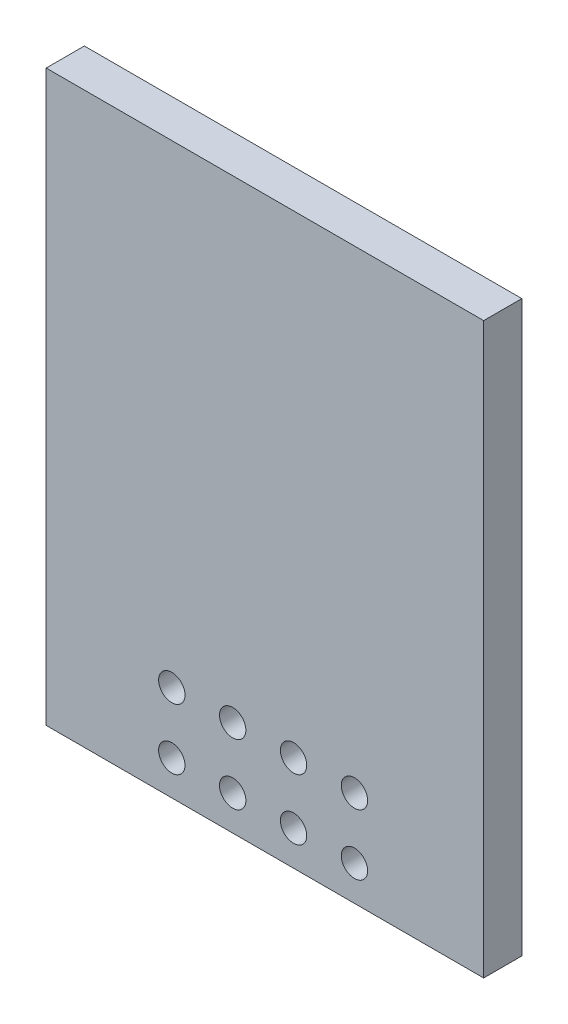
ISO-10303-21;
HEADER;
FILE_DESCRIPTION(('STEP AP214'),'2;1');
FILE_NAME('part.step','',(''),(''),'','','');
FILE_SCHEMA(('AUTOMOTIVE_DESIGN { 1 0 10303 214 1 1 1 1 }'));
ENDSEC;
DATA;
#1=APPLICATION_CONTEXT('core data for automotive mechanical design processes');
#2=APPLICATION_PROTOCOL_DEFINITION('international standard','automotive_design',2000,#1);
#3=PRODUCT_CONTEXT('',#1,'mechanical');
#4=PRODUCT('Part','Part','',(#3));
#5=PRODUCT_RELATED_PRODUCT_CATEGORY('part','',(#4));
#6=PRODUCT_DEFINITION_FORMATION('','',#4);
#7=PRODUCT_DEFINITION_CONTEXT('part definition',#1,'design');
#8=PRODUCT_DEFINITION('design','',#6,#7);
#9=PRODUCT_DEFINITION_SHAPE('','',#8);
#10=(LENGTH_UNIT() NAMED_UNIT(*) SI_UNIT(.MILLI.,.METRE.));
#11=(NAMED_UNIT(*) PLANE_ANGLE_UNIT() SI_UNIT($,.RADIAN.));
#12=(NAMED_UNIT(*) SI_UNIT($,.STERADIAN.) SOLID_ANGLE_UNIT());
#13=UNCERTAINTY_MEASURE_WITH_UNIT(LENGTH_MEASURE(1.E-05),#10,'distance_accuracy_value','');
#14=(GEOMETRIC_REPRESENTATION_CONTEXT(3) GLOBAL_UNCERTAINTY_ASSIGNED_CONTEXT((#13)) GLOBAL_UNIT_ASSIGNED_CONTEXT((#10,
#11,#12)) REPRESENTATION_CONTEXT('',''));
#15=CARTESIAN_POINT('',(0.,0.,0.));
#16=DIRECTION('',(0.,0.,1.));
#17=DIRECTION('',(1.,0.,0.));
#18=AXIS2_PLACEMENT_3D('',#15,#16,#17);
#19=CARTESIAN_POINT('',(26.25,26.25,1.59143954));
#20=DIRECTION('',(0.,0.,-1.));
#21=DIRECTION('',(-1.,0.,0.));
#22=AXIS2_PLACEMENT_3D('',#19,#20,#21);
#23=PLANE('',#22);
#24=CARTESIAN_POINT('',(39.11000052,30.24000048,1.59143954));
#25=DIRECTION('',(0.,0.,-1.));
#26=DIRECTION('',(-1.,0.,0.));
#27=AXIS2_PLACEMENT_3D('',#24,#25,#26);
#28=CIRCLE('',#27,0.5499989);
#29=CARTESIAN_POINT('',(38.56000162,30.24000048,1.59143954));
#30=VERTEX_POINT('',#29);
#31=EDGE_CURVE('E103',#30,#30,#28,.T.);
#32=ORIENTED_EDGE('',*,*,#31,.T.);
#33=EDGE_LOOP('',(#32));
#34=FACE_BOUND('',#33,.T.);
#35=CARTESIAN_POINT('',(36.57000052,30.24000048,1.59143954));
#36=DIRECTION('',(0.,0.,-1.));
#37=DIRECTION('',(-1.,0.,0.));
#38=AXIS2_PLACEMENT_3D('',#35,#36,#37);
#39=CIRCLE('',#38,0.5499989);
#40=CARTESIAN_POINT('',(36.02000162,30.24000048,1.59143954));
#41=VERTEX_POINT('',#40);
#42=EDGE_CURVE('E107',#41,#41,#39,.T.);
#43=ORIENTED_EDGE('',*,*,#42,.T.);
#44=EDGE_LOOP('',(#43));
#45=FACE_BOUND('',#44,.T.);
#46=CARTESIAN_POINT('',(39.11000052,27.70000048,1.59143954));
#47=DIRECTION('',(0.,0.,-1.));
#48=DIRECTION('',(-1.,0.,0.));
#49=AXIS2_PLACEMENT_3D('',#46,#47,#48);
#50=CIRCLE('',#49,0.5499989);
#51=CARTESIAN_POINT('',(38.56000162,27.70000048,1.59143954));
#52=VERTEX_POINT('',#51);
#53=EDGE_CURVE('E110',#52,#52,#50,.T.);
#54=ORIENTED_EDGE('',*,*,#53,.T.);
#55=EDGE_LOOP('',(#54));
#56=FACE_BOUND('',#55,.T.);
#57=CARTESIAN_POINT('',(36.57000052,27.70000048,1.59143954));
#58=DIRECTION('',(0.,0.,-1.));
#59=DIRECTION('',(-1.,0.,0.));
#60=AXIS2_PLACEMENT_3D('',#57,#58,#59);
#61=CIRCLE('',#60,0.5499989);
#62=CARTESIAN_POINT('',(36.02000162,27.70000048,1.59143954));
#63=VERTEX_POINT('',#62);
#64=EDGE_CURVE('E113',#63,#63,#61,.T.);
#65=ORIENTED_EDGE('',*,*,#64,.T.);
#66=EDGE_LOOP('',(#65));
#67=FACE_BOUND('',#66,.T.);
#68=CARTESIAN_POINT('',(34.03000052,30.24000048,1.59143954));
#69=DIRECTION('',(0.,0.,-1.));
#70=DIRECTION('',(-1.,0.,0.));
#71=AXIS2_PLACEMENT_3D('',#68,#69,#70);
#72=CIRCLE('',#71,0.5499989);
#73=CARTESIAN_POINT('',(33.48000162,30.24000048,1.59143954));
#74=VERTEX_POINT('',#73);
#75=EDGE_CURVE('E116',#74,#74,#72,.T.);
#76=ORIENTED_EDGE('',*,*,#75,.T.);
#77=EDGE_LOOP('',(#76));
#78=FACE_BOUND('',#77,.T.);
#79=CARTESIAN_POINT('',(31.49000052,30.24000048,1.59143954));
#80=DIRECTION('',(0.,0.,-1.));
#81=DIRECTION('',(-1.,0.,0.));
#82=AXIS2_PLACEMENT_3D('',#79,#80,#81);
#83=CIRCLE('',#82,0.5499989);
#84=CARTESIAN_POINT('',(30.94000162,30.24000048,1.59143954));
#85=VERTEX_POINT('',#84);
#86=EDGE_CURVE('E119',#85,#85,#83,.T.);
#87=ORIENTED_EDGE('',*,*,#86,.T.);
#88=EDGE_LOOP('',(#87));
#89=FACE_BOUND('',#88,.T.);
#90=CARTESIAN_POINT('',(34.03000052,27.70000048,1.59143954));
#91=DIRECTION('',(0.,0.,-1.));
#92=DIRECTION('',(-1.,0.,0.));
#93=AXIS2_PLACEMENT_3D('',#90,#91,#92);
#94=CIRCLE('',#93,0.5499989);
#95=CARTESIAN_POINT('',(33.48000162,27.70000048,1.59143954));
#96=VERTEX_POINT('',#95);
#97=EDGE_CURVE('E121',#96,#96,#94,.T.);
#98=ORIENTED_EDGE('',*,*,#97,.T.);
#99=EDGE_LOOP('',(#98));
#100=FACE_BOUND('',#99,.T.);
#101=CARTESIAN_POINT('',(31.49000052,27.70000048,1.59143954));
#102=DIRECTION('',(0.,0.,-1.));
#103=DIRECTION('',(-1.,0.,0.));
#104=AXIS2_PLACEMENT_3D('',#101,#102,#103);
#105=CIRCLE('',#104,0.5499989);
#106=CARTESIAN_POINT('',(30.94000162,27.70000048,1.59143954));
#107=VERTEX_POINT('',#106);
#108=EDGE_CURVE('E20',#107,#107,#105,.T.);
#109=ORIENTED_EDGE('',*,*,#108,.T.);
#110=EDGE_LOOP('',(#109));
#111=FACE_BOUND('',#110,.T.);
#112=DIRECTION('',(0.,1.,0.));
#113=VECTOR('',#112,1.);
#114=CARTESIAN_POINT('',(44.5,26.25,1.59143954));
#115=LINE('',#114,#113);
#116=CARTESIAN_POINT('',(44.5,26.25,1.59143954));
#117=VERTEX_POINT('',#116);
#118=CARTESIAN_POINT('',(44.5,50.,1.59143954));
#119=VERTEX_POINT('',#118);
#120=EDGE_CURVE('E55',#117,#119,#115,.T.);
#121=ORIENTED_EDGE('',*,*,#120,.T.);
#122=DIRECTION('',(1.,0.,0.));
#123=VECTOR('',#122,1.);
#124=CARTESIAN_POINT('',(44.5,50.,1.59143954));
#125=LINE('',#124,#123);
#126=CARTESIAN_POINT('',(26.25,50.,1.59143954));
#127=VERTEX_POINT('',#126);
#128=EDGE_CURVE('E57',#119,#127,#125,.F.);
#129=ORIENTED_EDGE('',*,*,#128,.T.);
#130=DIRECTION('',(0.,1.,0.));
#131=VECTOR('',#130,1.);
#132=CARTESIAN_POINT('',(26.25,50.,1.59143954));
#133=LINE('',#132,#131);
#134=CARTESIAN_POINT('',(26.25,26.25,1.59143954));
#135=VERTEX_POINT('',#134);
#136=EDGE_CURVE('E59',#127,#135,#133,.F.);
#137=ORIENTED_EDGE('',*,*,#136,.T.);
#138=DIRECTION('',(1.,0.,0.));
#139=VECTOR('',#138,1.);
#140=CARTESIAN_POINT('',(26.25,26.25,1.59143954));
#141=LINE('',#140,#139);
#142=EDGE_CURVE('E128',#135,#117,#141,.T.);
#143=ORIENTED_EDGE('',*,*,#142,.T.);
#144=EDGE_LOOP('',(#121,#129,#137,#143));
#145=FACE_BOUND('',#144,.T.);
#146=ADVANCED_FACE('F17',(#34,#45,#56,#67,#78,#89,#100,#111,#145),#23,.F.);
#147=CARTESIAN_POINT('',(26.25,50.,0.));
#148=DIRECTION('',(1.,0.,0.));
#149=DIRECTION('',(0.,0.,-1.));
#150=AXIS2_PLACEMENT_3D('',#147,#148,#149);
#151=PLANE('',#150);
#152=DIRECTION('',(0.,0.,1.));
#153=VECTOR('',#152,1.);
#154=CARTESIAN_POINT('',(26.25,26.25,0.));
#155=LINE('',#154,#153);
#156=CARTESIAN_POINT('',(26.25,26.25,0.));
#157=VERTEX_POINT('',#156);
#158=EDGE_CURVE('E70',#157,#135,#155,.T.);
#159=ORIENTED_EDGE('',*,*,#158,.T.);
#160=ORIENTED_EDGE('',*,*,#136,.F.);
#161=DIRECTION('',(0.,0.,-1.));
#162=VECTOR('',#161,1.);
#163=CARTESIAN_POINT('',(26.25,50.,0.));
#164=LINE('',#163,#162);
#165=CARTESIAN_POINT('',(26.25,50.,0.));
#166=VERTEX_POINT('',#165);
#167=EDGE_CURVE('E64',#127,#166,#164,.T.);
#168=ORIENTED_EDGE('',*,*,#167,.T.);
#169=DIRECTION('',(0.,1.,0.));
#170=VECTOR('',#169,1.);
#171=CARTESIAN_POINT('',(26.25,26.25,0.));
#172=LINE('',#171,#170);
#173=EDGE_CURVE('E106',#157,#166,#172,.T.);
#174=ORIENTED_EDGE('',*,*,#173,.F.);
#175=EDGE_LOOP('',(#159,#160,#168,#174));
#176=FACE_BOUND('',#175,.T.);
#177=ADVANCED_FACE('F67',(#176),#151,.F.);
#178=CARTESIAN_POINT('',(44.5,50.,0.));
#179=DIRECTION('',(0.,-1.,0.));
#180=DIRECTION('',(0.,0.,-1.));
#181=AXIS2_PLACEMENT_3D('',#178,#179,#180);
#182=PLANE('',#181);
#183=ORIENTED_EDGE('',*,*,#167,.F.);
#184=ORIENTED_EDGE('',*,*,#128,.F.);
#185=DIRECTION('',(0.,0.,1.));
#186=VECTOR('',#185,1.);
#187=CARTESIAN_POINT('',(44.5,50.,0.));
#188=LINE('',#187,#186);
#189=CARTESIAN_POINT('',(44.5,50.,0.));
#190=VERTEX_POINT('',#189);
#191=EDGE_CURVE('E78',#119,#190,#188,.F.);
#192=ORIENTED_EDGE('',*,*,#191,.T.);
#193=DIRECTION('',(-1.,0.,0.));
#194=VECTOR('',#193,1.);
#195=CARTESIAN_POINT('',(26.25,50.,0.));
#196=LINE('',#195,#194);
#197=EDGE_CURVE('E75',#166,#190,#196,.F.);
#198=ORIENTED_EDGE('',*,*,#197,.F.);
#199=EDGE_LOOP('',(#183,#184,#192,#198));
#200=FACE_BOUND('',#199,.T.);
#201=ADVANCED_FACE('F73',(#200),#182,.F.);
#202=CARTESIAN_POINT('',(44.5,26.25,0.));
#203=DIRECTION('',(-1.,0.,0.));
#204=DIRECTION('',(0.,0.,1.));
#205=AXIS2_PLACEMENT_3D('',#202,#203,#204);
#206=PLANE('',#205);
#207=ORIENTED_EDGE('',*,*,#191,.F.);
#208=ORIENTED_EDGE('',*,*,#120,.F.);
#209=DIRECTION('',(0.,0.,1.));
#210=VECTOR('',#209,1.);
#211=CARTESIAN_POINT('',(44.5,26.25,0.));
#212=LINE('',#211,#210);
#213=CARTESIAN_POINT('',(44.5,26.25,0.));
#214=VERTEX_POINT('',#213);
#215=EDGE_CURVE('E35',#117,#214,#212,.F.);
#216=ORIENTED_EDGE('',*,*,#215,.T.);
#217=DIRECTION('',(0.,1.,0.));
#218=VECTOR('',#217,1.);
#219=CARTESIAN_POINT('',(44.5,26.25,0.));
#220=LINE('',#219,#218);
#221=EDGE_CURVE('E135',#190,#214,#220,.F.);
#222=ORIENTED_EDGE('',*,*,#221,.F.);
#223=EDGE_LOOP('',(#207,#208,#216,#222));
#224=FACE_BOUND('',#223,.T.);
#225=ADVANCED_FACE('F136',(#224),#206,.F.);
#226=CARTESIAN_POINT('',(26.25,26.25,0.));
#227=DIRECTION('',(0.,1.,0.));
#228=DIRECTION('',(0.,0.,1.));
#229=AXIS2_PLACEMENT_3D('',#226,#227,#228);
#230=PLANE('',#229);
#231=ORIENTED_EDGE('',*,*,#215,.F.);
#232=ORIENTED_EDGE('',*,*,#142,.F.);
#233=ORIENTED_EDGE('',*,*,#158,.F.);
#234=DIRECTION('',(-1.,0.,0.));
#235=VECTOR('',#234,1.);
#236=CARTESIAN_POINT('',(26.25,26.25,0.));
#237=LINE('',#236,#235);
#238=EDGE_CURVE('E102',#214,#157,#237,.T.);
#239=ORIENTED_EDGE('',*,*,#238,.F.);
#240=EDGE_LOOP('',(#231,#232,#233,#239));
#241=FACE_BOUND('',#240,.T.);
#242=ADVANCED_FACE('F143',(#241),#230,.F.);
#243=CARTESIAN_POINT('',(31.49000052,27.70000048,0.));
#244=DIRECTION('',(0.,0.,-1.));
#245=DIRECTION('',(-1.,0.,0.));
#246=AXIS2_PLACEMENT_3D('',#243,#244,#245);
#247=CYLINDRICAL_SURFACE('',#246,0.5499989);
#248=ORIENTED_EDGE('',*,*,#108,.F.);
#249=EDGE_LOOP('',(#248));
#250=FACE_BOUND('',#249,.T.);
#251=CARTESIAN_POINT('',(31.49000052,27.70000048,0.));
#252=DIRECTION('',(0.,0.,-1.));
#253=DIRECTION('',(-1.,0.,0.));
#254=AXIS2_PLACEMENT_3D('',#251,#252,#253);
#255=CIRCLE('',#254,0.5499989);
#256=CARTESIAN_POINT('',(30.94000162,27.70000048,0.));
#257=VERTEX_POINT('',#256);
#258=EDGE_CURVE('E99',#257,#257,#255,.F.);
#259=ORIENTED_EDGE('',*,*,#258,.F.);
#260=EDGE_LOOP('',(#259));
#261=FACE_BOUND('',#260,.T.);
#262=ADVANCED_FACE('F145',(#250,#261),#247,.F.);
#263=CARTESIAN_POINT('',(34.03000052,27.70000048,0.));
#264=DIRECTION('',(0.,0.,-1.));
#265=DIRECTION('',(-1.,0.,0.));
#266=AXIS2_PLACEMENT_3D('',#263,#264,#265);
#267=CYLINDRICAL_SURFACE('',#266,0.5499989);
#268=ORIENTED_EDGE('',*,*,#97,.F.);
#269=EDGE_LOOP('',(#268));
#270=FACE_BOUND('',#269,.T.);
#271=CARTESIAN_POINT('',(34.03000052,27.70000048,0.));
#272=DIRECTION('',(0.,0.,-1.));
#273=DIRECTION('',(-1.,0.,0.));
#274=AXIS2_PLACEMENT_3D('',#271,#272,#273);
#275=CIRCLE('',#274,0.5499989);
#276=CARTESIAN_POINT('',(33.48000162,27.70000048,0.));
#277=VERTEX_POINT('',#276);
#278=EDGE_CURVE('E96',#277,#277,#275,.F.);
#279=ORIENTED_EDGE('',*,*,#278,.F.);
#280=EDGE_LOOP('',(#279));
#281=FACE_BOUND('',#280,.T.);
#282=ADVANCED_FACE('F152',(#270,#281),#267,.F.);
#283=CARTESIAN_POINT('',(31.49000052,30.24000048,0.));
#284=DIRECTION('',(0.,0.,-1.));
#285=DIRECTION('',(-1.,0.,0.));
#286=AXIS2_PLACEMENT_3D('',#283,#284,#285);
#287=CYLINDRICAL_SURFACE('',#286,0.5499989);
#288=ORIENTED_EDGE('',*,*,#86,.F.);
#289=EDGE_LOOP('',(#288));
#290=FACE_BOUND('',#289,.T.);
#291=CARTESIAN_POINT('',(31.49000052,30.24000048,0.));
#292=DIRECTION('',(0.,0.,-1.));
#293=DIRECTION('',(-1.,0.,0.));
#294=AXIS2_PLACEMENT_3D('',#291,#292,#293);
#295=CIRCLE('',#294,0.5499989);
#296=CARTESIAN_POINT('',(30.94000162,30.24000048,0.));
#297=VERTEX_POINT('',#296);
#298=EDGE_CURVE('E93',#297,#297,#295,.F.);
#299=ORIENTED_EDGE('',*,*,#298,.F.);
#300=EDGE_LOOP('',(#299));
#301=FACE_BOUND('',#300,.T.);
#302=ADVANCED_FACE('F182',(#290,#301),#287,.F.);
#303=CARTESIAN_POINT('',(34.03000052,30.24000048,0.));
#304=DIRECTION('',(0.,0.,-1.));
#305=DIRECTION('',(-1.,0.,0.));
#306=AXIS2_PLACEMENT_3D('',#303,#304,#305);
#307=CYLINDRICAL_SURFACE('',#306,0.5499989);
#308=ORIENTED_EDGE('',*,*,#75,.F.);
#309=EDGE_LOOP('',(#308));
#310=FACE_BOUND('',#309,.T.);
#311=CARTESIAN_POINT('',(34.03000052,30.24000048,0.));
#312=DIRECTION('',(0.,0.,-1.));
#313=DIRECTION('',(-1.,0.,0.));
#314=AXIS2_PLACEMENT_3D('',#311,#312,#313);
#315=CIRCLE('',#314,0.5499989);
#316=CARTESIAN_POINT('',(33.48000162,30.24000048,0.));
#317=VERTEX_POINT('',#316);
#318=EDGE_CURVE('E90',#317,#317,#315,.F.);
#319=ORIENTED_EDGE('',*,*,#318,.F.);
#320=EDGE_LOOP('',(#319));
#321=FACE_BOUND('',#320,.T.);
#322=ADVANCED_FACE('F178',(#310,#321),#307,.F.);
#323=CARTESIAN_POINT('',(36.57000052,27.70000048,0.));
#324=DIRECTION('',(0.,0.,-1.));
#325=DIRECTION('',(-1.,0.,0.));
#326=AXIS2_PLACEMENT_3D('',#323,#324,#325);
#327=CYLINDRICAL_SURFACE('',#326,0.5499989);
#328=ORIENTED_EDGE('',*,*,#64,.F.);
#329=EDGE_LOOP('',(#328));
#330=FACE_BOUND('',#329,.T.);
#331=CARTESIAN_POINT('',(36.57000052,27.70000048,0.));
#332=DIRECTION('',(0.,0.,-1.));
#333=DIRECTION('',(-1.,0.,0.));
#334=AXIS2_PLACEMENT_3D('',#331,#332,#333);
#335=CIRCLE('',#334,0.5499989);
#336=CARTESIAN_POINT('',(36.02000162,27.70000048,0.));
#337=VERTEX_POINT('',#336);
#338=EDGE_CURVE('E87',#337,#337,#335,.F.);
#339=ORIENTED_EDGE('',*,*,#338,.F.);
#340=EDGE_LOOP('',(#339));
#341=FACE_BOUND('',#340,.T.);
#342=ADVANCED_FACE('F174',(#330,#341),#327,.F.);
#343=CARTESIAN_POINT('',(39.11000052,27.70000048,0.));
#344=DIRECTION('',(0.,0.,-1.));
#345=DIRECTION('',(-1.,0.,0.));
#346=AXIS2_PLACEMENT_3D('',#343,#344,#345);
#347=CYLINDRICAL_SURFACE('',#346,0.5499989);
#348=ORIENTED_EDGE('',*,*,#53,.F.);
#349=EDGE_LOOP('',(#348));
#350=FACE_BOUND('',#349,.T.);
#351=CARTESIAN_POINT('',(39.11000052,27.70000048,0.));
#352=DIRECTION('',(0.,0.,-1.));
#353=DIRECTION('',(-1.,0.,0.));
#354=AXIS2_PLACEMENT_3D('',#351,#352,#353);
#355=CIRCLE('',#354,0.5499989);
#356=CARTESIAN_POINT('',(38.56000162,27.70000048,0.));
#357=VERTEX_POINT('',#356);
#358=EDGE_CURVE('E84',#357,#357,#355,.F.);
#359=ORIENTED_EDGE('',*,*,#358,.F.);
#360=EDGE_LOOP('',(#359));
#361=FACE_BOUND('',#360,.T.);
#362=ADVANCED_FACE('F170',(#350,#361),#347,.F.);
#363=CARTESIAN_POINT('',(36.57000052,30.24000048,0.));
#364=DIRECTION('',(0.,0.,-1.));
#365=DIRECTION('',(-1.,0.,0.));
#366=AXIS2_PLACEMENT_3D('',#363,#364,#365);
#367=CYLINDRICAL_SURFACE('',#366,0.5499989);
#368=ORIENTED_EDGE('',*,*,#42,.F.);
#369=EDGE_LOOP('',(#368));
#370=FACE_BOUND('',#369,.T.);
#371=CARTESIAN_POINT('',(36.57000052,30.24000048,0.));
#372=DIRECTION('',(0.,0.,-1.));
#373=DIRECTION('',(-1.,0.,0.));
#374=AXIS2_PLACEMENT_3D('',#371,#372,#373);
#375=CIRCLE('',#374,0.5499989);
#376=CARTESIAN_POINT('',(36.02000162,30.24000048,0.));
#377=VERTEX_POINT('',#376);
#378=EDGE_CURVE('E26',#377,#377,#375,.F.);
#379=ORIENTED_EDGE('',*,*,#378,.F.);
#380=EDGE_LOOP('',(#379));
#381=FACE_BOUND('',#380,.T.);
#382=ADVANCED_FACE('F163',(#370,#381),#367,.F.);
#383=CARTESIAN_POINT('',(39.11000052,30.24000048,0.));
#384=DIRECTION('',(0.,0.,-1.));
#385=DIRECTION('',(-1.,0.,0.));
#386=AXIS2_PLACEMENT_3D('',#383,#384,#385);
#387=CYLINDRICAL_SURFACE('',#386,0.5499989);
#388=ORIENTED_EDGE('',*,*,#31,.F.);
#389=EDGE_LOOP('',(#388));
#390=FACE_BOUND('',#389,.T.);
#391=CARTESIAN_POINT('',(39.11000052,30.24000048,0.));
#392=DIRECTION('',(0.,0.,-1.));
#393=DIRECTION('',(-1.,0.,0.));
#394=AXIS2_PLACEMENT_3D('',#391,#392,#393);
#395=CIRCLE('',#394,0.5499989);
#396=CARTESIAN_POINT('',(38.56000162,30.24000048,0.));
#397=VERTEX_POINT('',#396);
#398=EDGE_CURVE('E11',#397,#397,#395,.F.);
#399=ORIENTED_EDGE('',*,*,#398,.F.);
#400=EDGE_LOOP('',(#399));
#401=FACE_BOUND('',#400,.T.);
#402=ADVANCED_FACE('F157',(#390,#401),#387,.F.);
#403=CARTESIAN_POINT('',(26.25,26.25,0.));
#404=DIRECTION('',(0.,0.,-1.));
#405=DIRECTION('',(-1.,0.,0.));
#406=AXIS2_PLACEMENT_3D('',#403,#404,#405);
#407=PLANE('',#406);
#408=ORIENTED_EDGE('',*,*,#398,.T.);
#409=EDGE_LOOP('',(#408));
#410=FACE_BOUND('',#409,.T.);
#411=ORIENTED_EDGE('',*,*,#378,.T.);
#412=EDGE_LOOP('',(#411));
#413=FACE_BOUND('',#412,.T.);
#414=ORIENTED_EDGE('',*,*,#358,.T.);
#415=EDGE_LOOP('',(#414));
#416=FACE_BOUND('',#415,.T.);
#417=ORIENTED_EDGE('',*,*,#338,.T.);
#418=EDGE_LOOP('',(#417));
#419=FACE_BOUND('',#418,.T.);
#420=ORIENTED_EDGE('',*,*,#318,.T.);
#421=EDGE_LOOP('',(#420));
#422=FACE_BOUND('',#421,.T.);
#423=ORIENTED_EDGE('',*,*,#298,.T.);
#424=EDGE_LOOP('',(#423));
#425=FACE_BOUND('',#424,.T.);
#426=ORIENTED_EDGE('',*,*,#278,.T.);
#427=EDGE_LOOP('',(#426));
#428=FACE_BOUND('',#427,.T.);
#429=ORIENTED_EDGE('',*,*,#258,.T.);
#430=EDGE_LOOP('',(#429));
#431=FACE_BOUND('',#430,.T.);
#432=ORIENTED_EDGE('',*,*,#221,.T.);
#433=ORIENTED_EDGE('',*,*,#238,.T.);
#434=ORIENTED_EDGE('',*,*,#173,.T.);
#435=ORIENTED_EDGE('',*,*,#197,.T.);
#436=EDGE_LOOP('',(#432,#433,#434,#435));
#437=FACE_BOUND('',#436,.T.);
#438=ADVANCED_FACE('F140',(#410,#413,#416,#419,#422,#425,#428,#431,#437),#407,.T.);
#439=CLOSED_SHELL('',(#146,#177,#201,#225,#242,#262,#282,#302,#322,#342,#362,#382,#402,#438));
#440=MANIFOLD_SOLID_BREP('B1',#439);
#441=ADVANCED_BREP_SHAPE_REPRESENTATION('',(#18,#440),#14);
#442=SHAPE_DEFINITION_REPRESENTATION(#9,#441);
ENDSEC;
END-ISO-10303-21;
